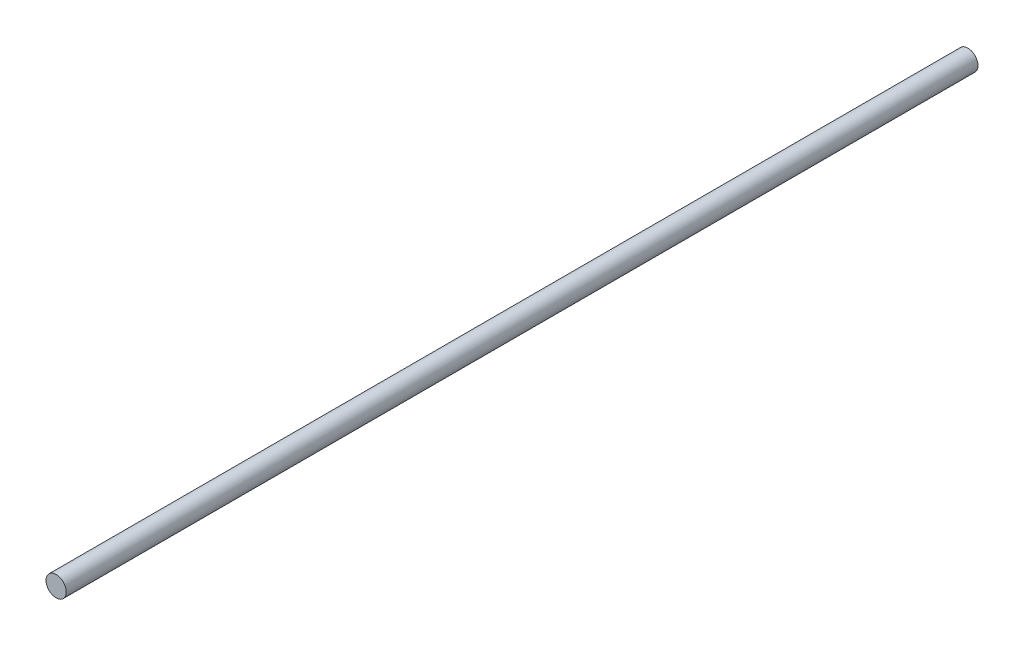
from build123d import *

# Parameters (mm, degrees)
SKETCH1_R           = 30
BOSS_EXTRUDE1_DEPTH = 2700


with BuildPart() as part:
    # Sketch1 → Boss-Extrude1 (new body)
    with BuildSketch(Plane.XY):
        Circle(SKETCH1_R)
    extrude(amount=-BOSS_EXTRUDE1_DEPTH)


solid = part.part
